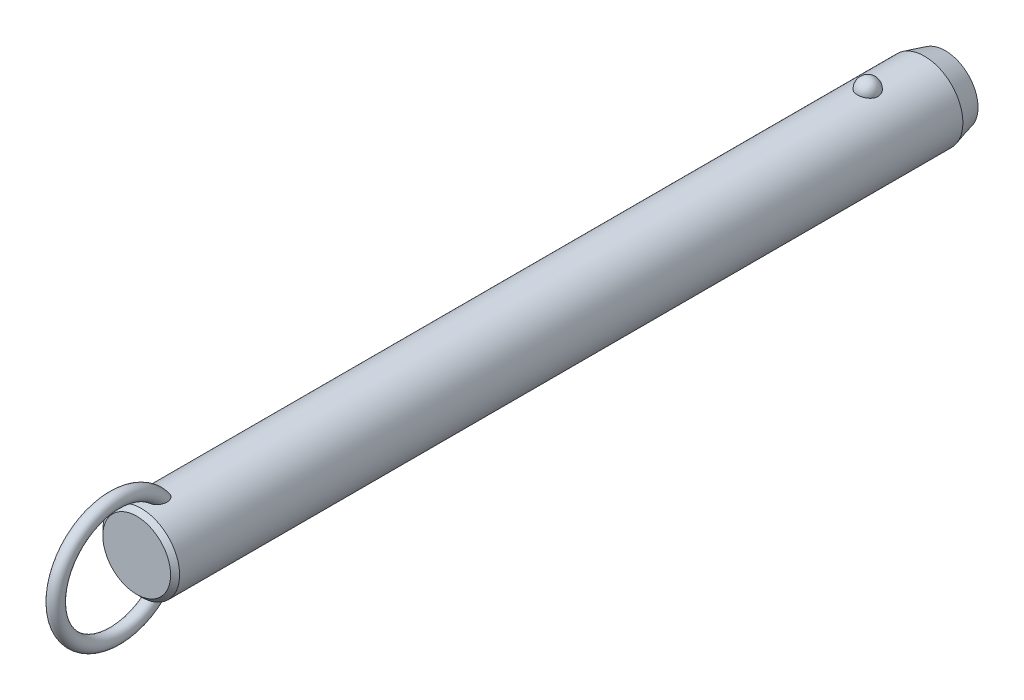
ISO-10303-21;
HEADER;
FILE_DESCRIPTION(('STEP AP214'),'2;1');
FILE_NAME('part.step','',(''),(''),'','','');
FILE_SCHEMA(('AUTOMOTIVE_DESIGN { 1 0 10303 214 1 1 1 1 }'));
ENDSEC;
DATA;
#1=APPLICATION_CONTEXT('core data for automotive mechanical design processes');
#2=APPLICATION_PROTOCOL_DEFINITION('international standard','automotive_design',2000,#1);
#3=PRODUCT_CONTEXT('',#1,'mechanical');
#4=PRODUCT('Part','Part','',(#3));
#5=PRODUCT_RELATED_PRODUCT_CATEGORY('part','',(#4));
#6=PRODUCT_DEFINITION_FORMATION('','',#4);
#7=PRODUCT_DEFINITION_CONTEXT('part definition',#1,'design');
#8=PRODUCT_DEFINITION('design','',#6,#7);
#9=PRODUCT_DEFINITION_SHAPE('','',#8);
#10=(LENGTH_UNIT() NAMED_UNIT(*) SI_UNIT(.MILLI.,.METRE.));
#11=(NAMED_UNIT(*) PLANE_ANGLE_UNIT() SI_UNIT($,.RADIAN.));
#12=(NAMED_UNIT(*) SI_UNIT($,.STERADIAN.) SOLID_ANGLE_UNIT());
#13=UNCERTAINTY_MEASURE_WITH_UNIT(LENGTH_MEASURE(1.E-05),#10,'distance_accuracy_value','');
#14=(GEOMETRIC_REPRESENTATION_CONTEXT(3) GLOBAL_UNCERTAINTY_ASSIGNED_CONTEXT((#13)) GLOBAL_UNIT_ASSIGNED_CONTEXT((#10,
#11,#12)) REPRESENTATION_CONTEXT('',''));
#15=CARTESIAN_POINT('',(0.,0.,0.));
#16=DIRECTION('',(0.,0.,1.));
#17=DIRECTION('',(1.,0.,0.));
#18=AXIS2_PLACEMENT_3D('',#15,#16,#17);
#19=CARTESIAN_POINT('',(0.,0.,195.6));
#20=DIRECTION('',(0.,0.,-1.));
#21=DIRECTION('',(-1.,0.,0.));
#22=AXIS2_PLACEMENT_3D('',#19,#20,#21);
#23=CYLINDRICAL_SURFACE('',#22,11.1);
#24=CARTESIAN_POINT('',(2.9724815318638,10.6945945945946,-3.00000000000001));
#25=CARTESIAN_POINT('',(2.97247830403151,10.6945972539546,-2.8322505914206));
#26=CARTESIAN_POINT('',(2.95876598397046,10.6984356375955,-2.66445972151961));
#27=CARTESIAN_POINT('',(2.90424529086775,10.7133624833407,-2.3336238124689));
#28=CARTESIAN_POINT('',(2.8634252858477,10.7244540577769,-2.17058084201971));
#29=CARTESIAN_POINT('',(2.75573657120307,10.7526272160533,-1.85396767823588));
#30=CARTESIAN_POINT('',(2.68887937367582,10.7697061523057,-1.70039333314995));
#31=CARTESIAN_POINT('',(2.53079696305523,10.8079438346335,-1.4069159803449));
#32=CARTESIAN_POINT('',(2.43957264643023,10.8291024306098,-1.26701246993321));
#33=CARTESIAN_POINT('',(2.23458150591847,10.8732541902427,-1.00409565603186));
#34=CARTESIAN_POINT('',(2.12071295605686,10.8962553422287,-0.881162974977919));
#35=CARTESIAN_POINT('',(1.87365402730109,10.9414421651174,-0.656352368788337));
#36=CARTESIAN_POINT('',(1.74046358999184,10.9636278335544,-0.554474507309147));
#37=CARTESIAN_POINT('',(1.45872188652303,11.0046495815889,-0.374872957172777));
#38=CARTESIAN_POINT('',(1.31021276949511,11.0234944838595,-0.297085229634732));
#39=CARTESIAN_POINT('',(1.00170030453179,11.0557957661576,-0.167529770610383));
#40=CARTESIAN_POINT('',(0.841698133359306,11.0692526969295,-0.1157593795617));
#41=CARTESIAN_POINT('',(0.517607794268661,11.0890932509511,-0.0403925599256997));
#42=CARTESIAN_POINT('',(0.353633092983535,11.0955916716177,-0.0163383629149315));
#43=CARTESIAN_POINT('',(0.0238420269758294,11.1011989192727,0.00445177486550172));
#44=CARTESIAN_POINT('',(-0.141974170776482,11.1003084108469,0.00119017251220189));
#45=CARTESIAN_POINT('',(-0.468405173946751,11.0912990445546,-0.0323233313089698));
#46=CARTESIAN_POINT('',(-0.629059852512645,11.0832767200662,-0.062214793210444));
#47=CARTESIAN_POINT('',(-0.942937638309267,11.0609962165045,-0.147645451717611));
#48=CARTESIAN_POINT('',(-1.09616062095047,11.0467379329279,-0.203185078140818));
#49=CARTESIAN_POINT('',(-1.39181061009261,11.0134071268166,-0.338752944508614));
#50=CARTESIAN_POINT('',(-1.53417383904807,10.9943086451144,-0.418913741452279));
#51=CARTESIAN_POINT('',(-1.80342160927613,10.9533667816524,-0.601448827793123));
#52=CARTESIAN_POINT('',(-1.9303046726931,10.9315231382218,-0.703825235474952));
#53=CARTESIAN_POINT('',(-2.16747598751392,10.887005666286,-0.930091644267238));
#54=CARTESIAN_POINT('',(-2.27742774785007,10.8643239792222,-1.05433291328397));
#55=CARTESIAN_POINT('',(-2.47517316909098,10.8209886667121,-1.31966633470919));
#56=CARTESIAN_POINT('',(-2.56296538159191,10.8003351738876,-1.46075958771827));
#57=CARTESIAN_POINT('',(-2.71500300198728,10.7631304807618,-1.75753646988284));
#58=CARTESIAN_POINT('',(-2.77898901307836,10.7466250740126,-1.91335887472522));
#59=CARTESIAN_POINT('',(-2.88046189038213,10.7198747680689,-2.23391529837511));
#60=CARTESIAN_POINT('',(-2.91794947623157,10.709629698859,-2.3986490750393));
#61=CARTESIAN_POINT('',(-2.96537819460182,10.6965949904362,-2.73165170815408));
#62=CARTESIAN_POINT('',(-2.97542891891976,10.693775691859,-2.89990378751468));
#63=CARTESIAN_POINT('',(-2.96804271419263,10.6958279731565,-3.23575286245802));
#64=CARTESIAN_POINT('',(-2.95060646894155,10.7006993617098,-3.4033498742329));
#65=CARTESIAN_POINT('',(-2.88883358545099,10.71753912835,-3.73233906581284));
#66=CARTESIAN_POINT('',(-2.84462026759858,10.7294749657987,-3.89375610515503));
#67=CARTESIAN_POINT('',(-2.73050447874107,10.7590797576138,-4.20667949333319));
#68=CARTESIAN_POINT('',(-2.66060103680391,10.7767489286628,-4.35818546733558));
#69=CARTESIAN_POINT('',(-2.49642559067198,10.8159599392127,-4.64785421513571));
#70=CARTESIAN_POINT('',(-2.40203047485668,10.8375211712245,-4.78594458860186));
#71=CARTESIAN_POINT('',(-2.19143488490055,10.8820570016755,-5.04410382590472));
#72=CARTESIAN_POINT('',(-2.07523364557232,10.9050316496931,-5.16417205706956));
#73=CARTESIAN_POINT('',(-1.82361254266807,10.9499219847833,-5.3833483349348));
#74=CARTESIAN_POINT('',(-1.68812945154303,10.9718338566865,-5.48238464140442));
#75=CARTESIAN_POINT('',(-1.40191298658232,11.0120611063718,-5.65618873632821));
#76=CARTESIAN_POINT('',(-1.25118062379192,11.0303767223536,-5.73095813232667));
#77=CARTESIAN_POINT('',(-0.940570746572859,11.0611653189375,-5.85334725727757));
#78=CARTESIAN_POINT('',(-0.780821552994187,11.0737044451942,-5.90127578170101));
#79=CARTESIAN_POINT('',(-0.455204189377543,11.0918598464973,-5.96992976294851));
#80=CARTESIAN_POINT('',(-0.289336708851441,11.0974768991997,-5.99065827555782));
#81=CARTESIAN_POINT('',(0.0406846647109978,11.1011307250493,-6.00418773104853));
#82=CARTESIAN_POINT('',(0.204817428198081,11.099299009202,-5.9974731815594));
#83=CARTESIAN_POINT('',(0.5295530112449,11.088551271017,-5.95740317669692));
#84=CARTESIAN_POINT('',(0.69015594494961,11.0796354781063,-5.92404858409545));
#85=CARTESIAN_POINT('',(1.0027760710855,11.0557204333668,-5.83180084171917));
#86=CARTESIAN_POINT('',(1.15482001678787,11.0407414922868,-5.7729929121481));
#87=CARTESIAN_POINT('',(1.44678373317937,11.0062913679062,-5.63147366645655));
#88=CARTESIAN_POINT('',(1.58670279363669,10.9868199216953,-5.54876095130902));
#89=CARTESIAN_POINT('',(1.8527023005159,10.9451315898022,-5.36027644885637));
#90=CARTESIAN_POINT('',(1.97855158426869,10.9228788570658,-5.25418644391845));
#91=CARTESIAN_POINT('',(2.21080872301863,10.8782509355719,-5.02251354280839));
#92=CARTESIAN_POINT('',(2.31721312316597,10.8558757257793,-4.89692718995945));
#93=CARTESIAN_POINT('',(2.5094551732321,10.8130715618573,-4.62745408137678));
#94=CARTESIAN_POINT('',(2.59493284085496,10.7926798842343,-4.48330448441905));
#95=CARTESIAN_POINT('',(2.740862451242,10.7565495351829,-4.18236358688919));
#96=CARTESIAN_POINT('',(2.80132490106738,10.7408089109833,-4.02557762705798));
#97=CARTESIAN_POINT('',(2.88959070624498,10.7173718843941,-3.72475308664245));
#98=CARTESIAN_POINT('',(2.92062102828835,10.7088950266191,-3.58171216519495));
#99=CARTESIAN_POINT('',(2.96206765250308,10.6975052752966,-3.29245795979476));
#100=CARTESIAN_POINT('',(2.97248434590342,10.6945922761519,-3.14624473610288));
#101=CARTESIAN_POINT('',(2.9724815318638,10.6945945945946,-3.00000000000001));
#102=B_SPLINE_CURVE_WITH_KNOTS('',3,(#24,#25,#26,#27,#28,#29,#30,#31,#32,#33,#34,#35,#36,#37,
#38,#39,#40,#41,#42,#43,#44,#45,#46,#47,#48,#49,#50,#51,#52,#53,#54,#55,#56,#57,#58,#59,#60,#61,
#62,#63,#64,#65,#66,#67,#68,#69,#70,#71,#72,#73,#74,#75,#76,#77,#78,#79,#80,#81,#82,#83,#84,#85,
#86,#87,#88,#89,#90,#91,#92,#93,#94,#95,#96,#97,#98,#99,#100,#101),.UNSPECIFIED.,.T.,.F.,(4,2,2,
2,2,2,2,2,2,2,2,2,2,2,2,2,2,2,2,2,2,2,2,2,2,2,2,2,2,2,2,2,2,2,2,2,2,2,4),(0.,0.502722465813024,
1.00566079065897,1.5083769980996,2.01107471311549,2.51608392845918,3.02109467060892,
3.52475118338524,4.02835620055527,4.523518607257,5.0186364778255,5.50715297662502,
5.9956776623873,6.48688002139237,6.97812923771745,7.47814366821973,7.9781907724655,
8.48353712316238,8.9888697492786,9.49218093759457,9.99547960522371,10.4964777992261,
10.997494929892,11.5010810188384,12.0046847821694,12.5099796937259,13.0152411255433,
13.5145635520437,14.0138298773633,14.5043200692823,14.9947943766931,15.4836390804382,
15.9725123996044,16.4685040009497,16.9645836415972,17.4686765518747,17.972557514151,
18.410841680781,18.849117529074),.UNSPECIFIED.);
#103=CARTESIAN_POINT('',(2.9724815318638,10.6945945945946,-3.00000000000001));
#104=VERTEX_POINT('',#103);
#105=EDGE_CURVE('E41',#104,#104,#102,.T.);
#106=ORIENTED_EDGE('',*,*,#105,.T.);
#107=EDGE_LOOP('',(#106));
#108=FACE_BOUND('',#107,.T.);
#109=CARTESIAN_POINT('',(0.,0.,207.));
#110=DIRECTION('',(0.,0.,1.));
#111=DIRECTION('',(1.,0.,0.));
#112=AXIS2_PLACEMENT_3D('',#109,#110,#111);
#113=CIRCLE('',#112,11.1);
#114=CARTESIAN_POINT('',(-11.1,0.,207.));
#115=VERTEX_POINT('',#114);
#116=EDGE_CURVE('E10',#115,#115,#113,.F.);
#117=ORIENTED_EDGE('',*,*,#116,.T.);
#118=EDGE_LOOP('',(#117));
#119=FACE_BOUND('',#118,.T.);
#120=CARTESIAN_POINT('',(-0.564520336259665,-11.0856356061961,199.257815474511));
#121=CARTESIAN_POINT('',(-0.667202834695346,-11.0804062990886,199.291283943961));
#122=CARTESIAN_POINT('',(-0.766875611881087,-11.0738877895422,199.333835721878));
#123=CARTESIAN_POINT('',(-0.95728412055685,-11.0590576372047,199.435419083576));
#124=CARTESIAN_POINT('',(-1.04801616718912,-11.0507452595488,199.49445742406));
#125=CARTESIAN_POINT('',(-1.21800952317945,-11.0333016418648,199.626529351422));
#126=CARTESIAN_POINT('',(-1.2973080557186,-11.0241732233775,199.699515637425));
#127=CARTESIAN_POINT('',(-1.44337665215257,-11.0060026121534,199.857037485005));
#128=CARTESIAN_POINT('',(-1.51014622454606,-10.9969604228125,199.941573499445));
#129=CARTESIAN_POINT('',(-1.63454620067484,-10.9791841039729,200.125521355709));
#130=CARTESIAN_POINT('',(-1.69127003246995,-10.9705107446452,200.225549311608));
#131=CARTESIAN_POINT('',(-1.7898078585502,-10.9548648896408,200.432790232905));
#132=CARTESIAN_POINT('',(-1.83161214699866,-10.9478935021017,200.540007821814));
#133=CARTESIAN_POINT('',(-1.91557028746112,-10.9335803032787,200.805408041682));
#134=CARTESIAN_POINT('',(-1.95040620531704,-10.9273269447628,200.965980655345));
#135=CARTESIAN_POINT('',(-1.99388326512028,-10.9194709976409,201.290697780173));
#136=CARTESIAN_POINT('',(-2.00248051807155,-10.9178762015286,201.454847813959));
#137=CARTESIAN_POINT('',(-1.99551615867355,-10.9191578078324,201.824650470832));
#138=CARTESIAN_POINT('',(-1.9732206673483,-10.9232807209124,202.030191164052));
#139=CARTESIAN_POINT('',(-1.9152976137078,-10.9335244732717,202.333595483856));
#140=CARTESIAN_POINT('',(-1.89184575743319,-10.9376266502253,202.434088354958));
#141=CARTESIAN_POINT('',(-1.83700674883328,-10.9469720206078,202.632855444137));
#142=CARTESIAN_POINT('',(-1.80562070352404,-10.9522150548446,202.731129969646));
#143=CARTESIAN_POINT('',(-1.73463055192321,-10.9636837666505,202.925914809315));
#144=CARTESIAN_POINT('',(-1.69493416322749,-10.9699202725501,203.022390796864));
#145=CARTESIAN_POINT('',(-1.60745141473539,-10.9830806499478,203.211626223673));
#146=CARTESIAN_POINT('',(-1.55966150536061,-10.9900048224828,203.304384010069));
#147=CARTESIAN_POINT('',(-1.45591812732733,-11.0042280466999,203.484690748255));
#148=CARTESIAN_POINT('',(-1.40000013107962,-11.0115253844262,203.572260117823));
#149=CARTESIAN_POINT('',(-1.27937470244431,-11.0261911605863,203.741029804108));
#150=CARTESIAN_POINT('',(-1.21467835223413,-11.0335594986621,203.82223795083));
#151=CARTESIAN_POINT('',(-1.08218150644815,-11.0473027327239,203.969001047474));
#152=CARTESIAN_POINT('',(-1.01522633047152,-11.0537063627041,204.035309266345));
#153=CARTESIAN_POINT('',(-0.872952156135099,-11.065850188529,204.158378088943));
#154=CARTESIAN_POINT('',(-0.797642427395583,-11.0715911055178,204.215149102));
#155=CARTESIAN_POINT('',(-0.651396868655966,-11.081071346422,204.307515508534));
#156=CARTESIAN_POINT('',(-0.581712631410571,-11.0849841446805,204.345049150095));
#157=CARTESIAN_POINT('',(-0.437066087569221,-11.0916271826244,204.408259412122));
#158=CARTESIAN_POINT('',(-0.362109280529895,-11.0943586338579,204.433948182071));
#159=CARTESIAN_POINT('',(-0.207828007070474,-11.0983242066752,204.471117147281));
#160=CARTESIAN_POINT('',(-0.12846771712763,-11.0995432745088,204.482454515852));
#161=CARTESIAN_POINT('',(0.0309101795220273,-11.1002423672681,204.488965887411));
#162=CARTESIAN_POINT('',(0.110927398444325,-11.0997233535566,204.484148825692));
#163=CARTESIAN_POINT('',(0.25640659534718,-11.097240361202,204.460959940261));
#164=CARTESIAN_POINT('',(0.322235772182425,-11.0955074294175,204.444754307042));
#165=CARTESIAN_POINT('',(0.450635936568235,-11.0910350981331,204.402600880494));
#166=CARTESIAN_POINT('',(0.513205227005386,-11.0882951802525,204.376648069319));
#167=CARTESIAN_POINT('',(0.662626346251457,-11.0805620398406,204.302607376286));
#168=CARTESIAN_POINT('',(0.747127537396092,-11.0751144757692,204.249845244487));
#169=CARTESIAN_POINT('',(0.906756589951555,-11.0631932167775,204.131720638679));
#170=CARTESIAN_POINT('',(0.981859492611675,-11.0567168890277,204.066325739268));
#171=CARTESIAN_POINT('',(1.10712207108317,-11.0447856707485,203.94226337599));
#172=CARTESIAN_POINT('',(1.15909566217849,-11.0394280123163,203.885383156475));
#173=CARTESIAN_POINT('',(1.2579192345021,-11.0286040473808,203.767327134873));
#174=CARTESIAN_POINT('',(1.30476642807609,-11.0231376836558,203.706149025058));
#175=CARTESIAN_POINT('',(1.43818612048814,-11.0068027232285,203.517305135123));
#176=CARTESIAN_POINT('',(1.51751767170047,-10.9960104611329,203.384453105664));
#177=CARTESIAN_POINT('',(1.63597546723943,-10.9788847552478,203.153137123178));
#178=CARTESIAN_POINT('',(1.67988876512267,-10.9722190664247,203.057053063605));
#179=CARTESIAN_POINT('',(1.75953241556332,-10.9597298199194,202.861431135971));
#180=CARTESIAN_POINT('',(1.7952596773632,-10.9539065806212,202.761891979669));
#181=CARTESIAN_POINT('',(1.85844731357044,-10.9433632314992,202.56021118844));
#182=CARTESIAN_POINT('',(1.8859107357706,-10.9386427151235,202.45807052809));
#183=CARTESIAN_POINT('',(1.93234324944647,-10.9305350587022,202.251819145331));
#184=CARTESIAN_POINT('',(1.95131065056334,-10.9271481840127,202.147708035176));
#185=CARTESIAN_POINT('',(1.99040203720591,-10.9201183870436,201.865458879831));
#186=CARTESIAN_POINT('',(2.00221217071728,-10.9179256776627,201.686037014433));
#187=CARTESIAN_POINT('',(1.99711676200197,-10.9188636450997,201.327713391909));
#188=CARTESIAN_POINT('',(1.98026150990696,-10.9219849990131,201.148811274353));
#189=CARTESIAN_POINT('',(1.92151657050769,-10.9324473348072,200.83645144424));
#190=CARTESIAN_POINT('',(1.88605081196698,-10.9386915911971,200.701759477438));
#191=CARTESIAN_POINT('',(1.79393020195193,-10.9541780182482,200.439966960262));
#192=CARTESIAN_POINT('',(1.73729868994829,-10.9634168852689,200.312858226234));
#193=CARTESIAN_POINT('',(1.61237037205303,-10.9824218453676,200.089418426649));
#194=CARTESIAN_POINT('',(1.54715374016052,-10.9918945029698,199.991345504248));
#195=CARTESIAN_POINT('',(1.40127026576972,-11.0114415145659,199.807434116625));
#196=CARTESIAN_POINT('',(1.32060742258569,-11.0215157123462,199.721592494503));
#197=CARTESIAN_POINT('',(1.1447478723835,-11.041168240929,199.565163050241));
#198=CARTESIAN_POINT('',(1.04947805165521,-11.0507437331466,199.494656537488));
#199=CARTESIAN_POINT('',(0.847278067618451,-11.0680789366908,199.372640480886));
#200=CARTESIAN_POINT('',(0.740351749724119,-11.0758392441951,199.321124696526));
#201=CARTESIAN_POINT('',(0.529289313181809,-11.0878275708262,199.243485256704));
#202=CARTESIAN_POINT('',(0.425895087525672,-11.0923259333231,199.215377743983));
#203=CARTESIAN_POINT('',(0.215723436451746,-11.0984001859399,199.177703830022));
#204=CARTESIAN_POINT('',(0.10894793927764,-11.0999777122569,199.168127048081));
#205=CARTESIAN_POINT('',(-0.0938962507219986,-11.1000196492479,199.167877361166));
#206=CARTESIAN_POINT('',(-0.189967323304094,-11.0987797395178,199.175408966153));
#207=CARTESIAN_POINT('',(-0.379657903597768,-11.0939111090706,199.205507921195));
#208=CARTESIAN_POINT('',(-0.47327735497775,-11.0902823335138,199.228075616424));
#209=CARTESIAN_POINT('',(-0.564520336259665,-11.0856356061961,199.257815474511));
#210=B_SPLINE_CURVE_WITH_KNOTS('',3,(#120,#121,#122,#123,#124,#125,#126,#127,#128,#129,#130,
#131,#132,#133,#134,#135,#136,#137,#138,#139,#140,#141,#142,#143,#144,#145,#146,#147,#148,#149,
#150,#151,#152,#153,#154,#155,#156,#157,#158,#159,#160,#161,#162,#163,#164,#165,#166,#167,#168,
#169,#170,#171,#172,#173,#174,#175,#176,#177,#178,#179,#180,#181,#182,#183,#184,#185,#186,#187,
#188,#189,#190,#191,#192,#193,#194,#195,#196,#197,#198,#199,#200,#201,#202,#203,#204,#205,#206,
#207,#208,#209),.UNSPECIFIED.,.T.,.F.,(4,2,2,2,2,2,2,2,2,2,2,2,2,2,2,2,2,2,2,2,2,2,2,2,2,2,2,2,
2,2,2,2,2,2,2,2,2,2,2,2,2,2,2,2,4),(0.,0.323999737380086,0.64813245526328,0.971184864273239,
1.29424994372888,1.63886237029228,1.98369857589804,2.47426059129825,2.96564271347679,
3.58257396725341,3.89215258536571,4.20168803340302,4.51486273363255,4.82817514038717,
5.14015911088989,5.45175282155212,5.73442856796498,6.01679375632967,6.2536458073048,
6.49025437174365,6.72919963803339,6.96801276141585,7.17061258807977,7.37331685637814,
7.67094989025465,7.96935728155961,8.20075067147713,8.43226927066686,8.89581623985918,
9.21306533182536,9.53043400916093,9.84768549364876,10.1650000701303,10.7022930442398,
11.2386443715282,11.655339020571,12.071575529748,12.4245637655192,12.7774607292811,
13.1321855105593,13.4867936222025,13.8068771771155,14.1267813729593,14.4146787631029,
14.7025827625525),.UNSPECIFIED.);
#211=CARTESIAN_POINT('',(-0.564520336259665,-11.0856356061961,199.257815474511));
#212=VERTEX_POINT('',#211);
#213=EDGE_CURVE('E59',#212,#212,#210,.T.);
#214=ORIENTED_EDGE('',*,*,#213,.T.);
#215=EDGE_LOOP('',(#214));
#216=FACE_BOUND('',#215,.T.);
#217=CARTESIAN_POINT('',(-0.564520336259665,11.0856356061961,199.257815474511));
#218=CARTESIAN_POINT('',(-0.468542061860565,11.0905203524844,199.226545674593));
#219=CARTESIAN_POINT('',(-0.369793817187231,11.0942886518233,199.203157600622));
#220=CARTESIAN_POINT('',(-0.169555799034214,11.0991586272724,199.173085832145));
#221=CARTESIAN_POINT('',(-0.0680604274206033,11.1002543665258,199.16643932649));
#222=CARTESIAN_POINT('',(0.134549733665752,11.099646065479,199.170157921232));
#223=CARTESIAN_POINT('',(0.235664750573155,11.0979441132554,199.18051033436));
#224=CARTESIAN_POINT('',(0.434632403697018,11.0919342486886,199.217831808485));
#225=CARTESIAN_POINT('',(0.532486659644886,11.0876276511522,199.244792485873));
#226=CARTESIAN_POINT('',(0.722445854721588,11.0768742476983,199.3144096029));
#227=CARTESIAN_POINT('',(0.814543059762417,11.0704246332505,199.357086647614));
#228=CARTESIAN_POINT('',(0.990565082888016,11.0560659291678,199.456648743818));
#229=CARTESIAN_POINT('',(1.07448844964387,11.048156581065,199.513536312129));
#230=CARTESIAN_POINT('',(1.23562672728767,11.0313221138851,199.642210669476));
#231=CARTESIAN_POINT('',(1.3124268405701,11.0223686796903,199.714511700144));
#232=CARTESIAN_POINT('',(1.45398030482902,11.0045918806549,199.870042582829));
#233=CARTESIAN_POINT('',(1.51873073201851,10.9957685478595,199.953275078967));
#234=CARTESIAN_POINT('',(1.64107232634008,10.9782087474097,200.136384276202));
#235=CARTESIAN_POINT('',(1.6974317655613,10.9695572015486,200.237089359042));
#236=CARTESIAN_POINT('',(1.79515063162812,10.9539887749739,200.445626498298));
#237=CARTESIAN_POINT('',(1.83649966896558,10.9470730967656,200.55346343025));
#238=CARTESIAN_POINT('',(1.91931148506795,10.9329211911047,200.820399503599));
#239=CARTESIAN_POINT('',(1.95340104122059,10.9267904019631,200.981861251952));
#240=CARTESIAN_POINT('',(1.99526195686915,10.9192174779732,201.30821631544));
#241=CARTESIAN_POINT('',(2.00298989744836,10.9177830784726,201.47311484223));
#242=CARTESIAN_POINT('',(1.99396251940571,10.9194420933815,201.844100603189));
#243=CARTESIAN_POINT('',(1.97050829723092,10.923774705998,202.05003871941));
#244=CARTESIAN_POINT('',(1.91079643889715,10.9343131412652,202.353901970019));
#245=CARTESIAN_POINT('',(1.88673702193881,10.9385106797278,202.454529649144));
#246=CARTESIAN_POINT('',(1.8306550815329,10.9480376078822,202.653510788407));
#247=CARTESIAN_POINT('',(1.79863369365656,10.9533668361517,202.751864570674));
#248=CARTESIAN_POINT('',(1.72633365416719,10.9649954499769,202.946720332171));
#249=CARTESIAN_POINT('',(1.68596409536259,10.9713053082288,203.04318790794));
#250=CARTESIAN_POINT('',(1.59707998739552,10.9845964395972,203.232323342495));
#251=CARTESIAN_POINT('',(1.54856169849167,10.9915780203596,203.324989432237));
#252=CARTESIAN_POINT('',(1.44330168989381,11.0058935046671,203.504975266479));
#253=CARTESIAN_POINT('',(1.3865974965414,11.0132257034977,203.592316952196));
#254=CARTESIAN_POINT('',(1.2643115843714,11.0279330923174,203.760456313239));
#255=CARTESIAN_POINT('',(1.19874160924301,11.0353082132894,203.841262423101));
#256=CARTESIAN_POINT('',(1.06542088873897,11.048931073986,203.985985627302));
#257=CARTESIAN_POINT('',(0.998640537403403,11.0552153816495,204.050784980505));
#258=CARTESIAN_POINT('',(0.856896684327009,11.0671032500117,204.170846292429));
#259=CARTESIAN_POINT('',(0.781942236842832,11.0727075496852,204.226118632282));
#260=CARTESIAN_POINT('',(0.636276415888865,11.081949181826,204.315972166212));
#261=CARTESIAN_POINT('',(0.566755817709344,11.0857572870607,204.352441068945));
#262=CARTESIAN_POINT('',(0.422602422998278,11.0921860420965,204.413533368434));
#263=CARTESIAN_POINT('',(0.347974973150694,11.0948079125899,204.438168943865));
#264=CARTESIAN_POINT('',(0.194593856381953,11.0985608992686,204.473323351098));
#265=CARTESIAN_POINT('',(0.115807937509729,11.0996777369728,204.483706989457));
#266=CARTESIAN_POINT('',(-0.0422499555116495,11.1002003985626,204.488574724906));
#267=CARTESIAN_POINT('',(-0.121521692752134,11.09960699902,204.483066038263));
#268=CARTESIAN_POINT('',(-0.26604624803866,11.0970123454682,204.458827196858));
#269=CARTESIAN_POINT('',(-0.331661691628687,11.0952283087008,204.442135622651));
#270=CARTESIAN_POINT('',(-0.459588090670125,11.0906663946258,204.399111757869));
#271=CARTESIAN_POINT('',(-0.521897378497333,11.0878880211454,204.372774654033));
#272=CARTESIAN_POINT('',(-0.671446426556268,11.0800342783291,204.297513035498));
#273=CARTESIAN_POINT('',(-0.756250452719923,11.0744969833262,204.243818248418));
#274=CARTESIAN_POINT('',(-0.916349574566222,11.0624045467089,204.123802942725));
#275=CARTESIAN_POINT('',(-0.991618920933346,11.0558467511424,204.057449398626));
#276=CARTESIAN_POINT('',(-1.11713140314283,11.0437783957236,203.931633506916));
#277=CARTESIAN_POINT('',(-1.16920539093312,11.0383619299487,203.873952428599));
#278=CARTESIAN_POINT('',(-1.26817476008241,11.02743010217,203.754280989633));
#279=CARTESIAN_POINT('',(-1.31506731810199,11.0219146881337,203.692288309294));
#280=CARTESIAN_POINT('',(-1.40399813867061,11.0109399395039,203.564784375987));
#281=CARTESIAN_POINT('',(-1.44602864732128,11.0054807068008,203.499267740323));
#282=CARTESIAN_POINT('',(-1.52538779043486,10.9947621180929,203.365422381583));
#283=CARTESIAN_POINT('',(-1.56271516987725,10.9895028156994,203.297092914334));
#284=CARTESIAN_POINT('',(-1.64537943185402,10.9774790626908,203.133210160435));
#285=CARTESIAN_POINT('',(-1.68879497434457,10.9708503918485,203.0366735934));
#286=CARTESIAN_POINT('',(-1.76740738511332,10.9584602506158,202.840236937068));
#287=CARTESIAN_POINT('',(-1.80260120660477,10.95269910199,202.74033561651));
#288=CARTESIAN_POINT('',(-1.86468657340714,10.9423003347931,202.537966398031));
#289=CARTESIAN_POINT('',(-1.8915816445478,10.9376622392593,202.435499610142));
#290=CARTESIAN_POINT('',(-1.93682458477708,10.9297405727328,202.228642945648));
#291=CARTESIAN_POINT('',(-1.95517082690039,10.9264572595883,202.124252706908));
#292=CARTESIAN_POINT('',(-1.99232562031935,10.9197647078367,201.84262876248));
#293=CARTESIAN_POINT('',(-2.00294603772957,10.9177914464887,201.664185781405));
#294=CARTESIAN_POINT('',(-1.99566675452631,10.9191290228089,201.307996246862));
#295=CARTESIAN_POINT('',(-1.97781651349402,10.9224306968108,201.13024902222));
#296=CARTESIAN_POINT('',(-1.91747214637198,10.9331592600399,200.819792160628));
#297=CARTESIAN_POINT('',(-1.88131022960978,10.9395108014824,200.685825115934));
#298=CARTESIAN_POINT('',(-1.78790380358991,10.9551659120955,200.42559757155));
#299=CARTESIAN_POINT('',(-1.73068309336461,10.9644661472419,200.299328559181));
#300=CARTESIAN_POINT('',(-1.60475573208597,10.9835398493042,200.07741565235));
#301=CARTESIAN_POINT('',(-1.53908879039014,10.9930297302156,199.980026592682));
#302=CARTESIAN_POINT('',(-1.39238608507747,11.0125708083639,199.797525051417));
#303=CARTESIAN_POINT('',(-1.31135150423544,11.0226219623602,199.712411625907));
#304=CARTESIAN_POINT('',(-1.14382035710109,11.0411991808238,199.56529943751));
#305=CARTESIAN_POINT('',(-1.0585850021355,11.0497792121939,199.50186930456));
#306=CARTESIAN_POINT('',(-0.878723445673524,11.0655285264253,199.390250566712));
#307=CARTESIAN_POINT('',(-0.784123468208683,11.0727015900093,199.342020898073));
#308=CARTESIAN_POINT('',(-0.646163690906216,11.0812501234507,199.286023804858));
#309=CARTESIAN_POINT('',(-0.605595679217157,11.0835451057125,199.271197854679));
#310=CARTESIAN_POINT('',(-0.564520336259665,11.0856356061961,199.257815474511));
#311=B_SPLINE_CURVE_WITH_KNOTS('',3,(#217,#218,#219,#220,#221,#222,#223,#224,#225,#226,#227,
#228,#229,#230,#231,#232,#233,#234,#235,#236,#237,#238,#239,#240,#241,#242,#243,#244,#245,#246,
#247,#248,#249,#250,#251,#252,#253,#254,#255,#256,#257,#258,#259,#260,#261,#262,#263,#264,#265,
#266,#267,#268,#269,#270,#271,#272,#273,#274,#275,#276,#277,#278,#279,#280,#281,#282,#283,#284,
#285,#286,#287,#288,#289,#290,#291,#292,#293,#294,#295,#296,#297,#298,#299,#300,#301,#302,#303,
#304,#305,#306,#307,#308,#309,#310),.UNSPECIFIED.,.T.,.F.,(4,2,2,2,2,2,2,2,2,2,2,2,2,2,2,2,2,2,
2,2,2,2,2,2,2,2,2,2,2,2,2,2,2,2,2,2,2,2,2,2,2,2,2,2,2,2,4),(0.,0.303061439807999,
0.606795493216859,0.910302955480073,1.21365733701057,1.51741085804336,1.82121821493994,
2.13745205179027,2.45376252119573,2.79958678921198,3.14564996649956,3.63832391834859,
4.13180893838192,4.75031912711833,5.06071926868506,5.37107516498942,5.6850077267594,
5.99908475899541,6.31176519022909,6.62403542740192,6.90315673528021,7.18197194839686,
7.41687778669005,7.65154134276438,7.88841587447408,8.12518286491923,8.32752842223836,
8.52997509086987,8.82986421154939,9.13054668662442,9.36393502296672,9.59744991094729,
9.83133221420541,10.0652767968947,10.383032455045,10.7009056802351,11.0186436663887,
11.3364420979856,11.8705925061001,12.4038159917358,12.8189662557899,13.2336487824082,
13.5857049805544,13.9377340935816,14.2561354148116,14.5736690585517,14.7033687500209),.UNSPECIFIED.);
#312=CARTESIAN_POINT('',(-0.564520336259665,11.0856356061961,199.257815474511));
#313=VERTEX_POINT('',#312);
#314=EDGE_CURVE('E67',#313,#313,#311,.T.);
#315=ORIENTED_EDGE('',*,*,#314,.T.);
#316=EDGE_LOOP('',(#315));
#317=FACE_BOUND('',#316,.T.);
#318=CARTESIAN_POINT('',(0.,0.,-19.3999999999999));
#319=DIRECTION('',(0.,0.,-1.));
#320=DIRECTION('',(-1.,0.,0.));
#321=AXIS2_PLACEMENT_3D('',#318,#319,#320);
#322=CIRCLE('',#321,11.1);
#323=CARTESIAN_POINT('',(-11.1,0.,-19.3999999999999));
#324=VERTEX_POINT('',#323);
#325=EDGE_CURVE('E56',#324,#324,#322,.F.);
#326=ORIENTED_EDGE('',*,*,#325,.T.);
#327=EDGE_LOOP('',(#326));
#328=FACE_BOUND('',#327,.T.);
#329=ADVANCED_FACE('F37',(#108,#119,#216,#317,#328),#23,.T.);
#330=CARTESIAN_POINT('',(0.,0.,-25.4));
#331=DIRECTION('',(0.,0.,-1.));
#332=DIRECTION('',(-1.,0.,0.));
#333=AXIS2_PLACEMENT_3D('',#330,#331,#332);
#334=PLANE('',#333);
#335=CARTESIAN_POINT('',(0.,0.,-25.4));
#336=DIRECTION('',(0.,0.,-1.));
#337=DIRECTION('',(-1.,0.,0.));
#338=AXIS2_PLACEMENT_3D('',#335,#336,#337);
#339=CIRCLE('',#338,9.49230484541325);
#340=CARTESIAN_POINT('',(-9.49230484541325,0.,-25.4));
#341=VERTEX_POINT('',#340);
#342=EDGE_CURVE('E66',#341,#341,#339,.T.);
#343=ORIENTED_EDGE('',*,*,#342,.T.);
#344=EDGE_LOOP('',(#343));
#345=FACE_BOUND('',#344,.T.);
#346=ADVANCED_FACE('F85',(#345),#334,.T.);
#347=CARTESIAN_POINT('',(0.,0.,-25.4));
#348=DIRECTION('',(0.,0.,1.));
#349=DIRECTION('',(1.,0.,0.));
#350=AXIS2_PLACEMENT_3D('',#347,#348,#349);
#351=CONICAL_SURFACE('',#350,9.49230484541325,0.261799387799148);
#352=ORIENTED_EDGE('',*,*,#325,.F.);
#353=EDGE_LOOP('',(#352));
#354=FACE_BOUND('',#353,.T.);
#355=ORIENTED_EDGE('',*,*,#342,.F.);
#356=EDGE_LOOP('',(#355));
#357=FACE_BOUND('',#356,.T.);
#358=ADVANCED_FACE('F83',(#354,#357),#351,.T.);
#359=CARTESIAN_POINT('',(0.,0.,208.3));
#360=DIRECTION('',(0.,0.,1.));
#361=DIRECTION('',(1.,0.,0.));
#362=AXIS2_PLACEMENT_3D('',#359,#360,#361);
#363=PLANE('',#362);
#364=CARTESIAN_POINT('',(0.,0.,208.3));
#365=DIRECTION('',(0.,0.,1.));
#366=DIRECTION('',(1.,0.,0.));
#367=AXIS2_PLACEMENT_3D('',#364,#365,#366);
#368=CIRCLE('',#367,9.79999999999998);
#369=CARTESIAN_POINT('',(-9.79999999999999,0.,208.3));
#370=VERTEX_POINT('',#369);
#371=EDGE_CURVE('E50',#370,#370,#368,.T.);
#372=ORIENTED_EDGE('',*,*,#371,.T.);
#373=EDGE_LOOP('',(#372));
#374=FACE_BOUND('',#373,.T.);
#375=ADVANCED_FACE('F77',(#374),#363,.T.);
#376=CARTESIAN_POINT('',(0.,0.,214.65));
#377=DIRECTION('',(1.,0.,0.));
#378=DIRECTION('',(0.,0.,-1.));
#379=AXIS2_PLACEMENT_3D('',#376,#377,#378);
#380=TOROIDAL_SURFACE('',#379,17.05,2.);
#381=ORIENTED_EDGE('',*,*,#314,.F.);
#382=EDGE_LOOP('',(#381));
#383=FACE_BOUND('',#382,.T.);
#384=ORIENTED_EDGE('',*,*,#213,.F.);
#385=EDGE_LOOP('',(#384));
#386=FACE_BOUND('',#385,.T.);
#387=ADVANCED_FACE('F73',(#383,#386),#380,.T.);
#388=CARTESIAN_POINT('',(0.,0.,208.3));
#389=DIRECTION('',(0.,0.,-1.));
#390=DIRECTION('',(-1.,0.,0.));
#391=AXIS2_PLACEMENT_3D('',#388,#389,#390);
#392=CONICAL_SURFACE('',#391,9.79999999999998,0.785398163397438);
#393=CARTESIAN_POINT('',(-11.1,0.,207.));
#394=CARTESIAN_POINT('',(-11.0864583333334,0.,207.013541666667));
#395=CARTESIAN_POINT('',(-11.0729166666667,0.,207.027083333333));
#396=CARTESIAN_POINT('',(-11.0458333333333,0.,207.054166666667));
#397=CARTESIAN_POINT('',(-11.0322916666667,0.,207.067708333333));
#398=CARTESIAN_POINT('',(-11.0052083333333,0.,207.094791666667));
#399=CARTESIAN_POINT('',(-10.9916666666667,0.,207.108333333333));
#400=CARTESIAN_POINT('',(-10.9645833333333,0.,207.135416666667));
#401=CARTESIAN_POINT('',(-10.9510416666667,0.,207.148958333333));
#402=CARTESIAN_POINT('',(-10.9239583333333,0.,207.176041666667));
#403=CARTESIAN_POINT('',(-10.9104166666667,0.,207.189583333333));
#404=CARTESIAN_POINT('',(-10.8833333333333,0.,207.216666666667));
#405=CARTESIAN_POINT('',(-10.8697916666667,0.,207.230208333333));
#406=CARTESIAN_POINT('',(-10.8427083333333,0.,207.257291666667));
#407=CARTESIAN_POINT('',(-10.8291666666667,0.,207.270833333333));
#408=CARTESIAN_POINT('',(-10.8020833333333,0.,207.297916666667));
#409=CARTESIAN_POINT('',(-10.7885416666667,0.,207.311458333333));
#410=CARTESIAN_POINT('',(-10.7614583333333,0.,207.338541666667));
#411=CARTESIAN_POINT('',(-10.7479166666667,0.,207.352083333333));
#412=CARTESIAN_POINT('',(-10.7208333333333,0.,207.379166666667));
#413=CARTESIAN_POINT('',(-10.7072916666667,0.,207.392708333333));
#414=CARTESIAN_POINT('',(-10.6802083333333,0.,207.419791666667));
#415=CARTESIAN_POINT('',(-10.6666666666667,0.,207.433333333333));
#416=CARTESIAN_POINT('',(-10.6395833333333,0.,207.460416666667));
#417=CARTESIAN_POINT('',(-10.6260416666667,0.,207.473958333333));
#418=CARTESIAN_POINT('',(-10.5989583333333,0.,207.501041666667));
#419=CARTESIAN_POINT('',(-10.5854166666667,0.,207.514583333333));
#420=CARTESIAN_POINT('',(-10.5583333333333,0.,207.541666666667));
#421=CARTESIAN_POINT('',(-10.5447916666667,0.,207.555208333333));
#422=CARTESIAN_POINT('',(-10.5177083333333,0.,207.582291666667));
#423=CARTESIAN_POINT('',(-10.5041666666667,0.,207.595833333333));
#424=CARTESIAN_POINT('',(-10.4770833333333,0.,207.622916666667));
#425=CARTESIAN_POINT('',(-10.4635416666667,0.,207.636458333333));
#426=CARTESIAN_POINT('',(-10.4364583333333,0.,207.663541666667));
#427=CARTESIAN_POINT('',(-10.4229166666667,0.,207.677083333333));
#428=CARTESIAN_POINT('',(-10.3958333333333,0.,207.704166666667));
#429=CARTESIAN_POINT('',(-10.3822916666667,0.,207.717708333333));
#430=CARTESIAN_POINT('',(-10.3552083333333,0.,207.744791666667));
#431=CARTESIAN_POINT('',(-10.3416666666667,0.,207.758333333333));
#432=CARTESIAN_POINT('',(-10.3145833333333,0.,207.785416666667));
#433=CARTESIAN_POINT('',(-10.3010416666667,0.,207.798958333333));
#434=CARTESIAN_POINT('',(-10.2739583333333,0.,207.826041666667));
#435=CARTESIAN_POINT('',(-10.2604166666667,0.,207.839583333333));
#436=CARTESIAN_POINT('',(-10.2333333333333,0.,207.866666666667));
#437=CARTESIAN_POINT('',(-10.2197916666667,0.,207.880208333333));
#438=CARTESIAN_POINT('',(-10.1927083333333,0.,207.907291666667));
#439=CARTESIAN_POINT('',(-10.1791666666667,0.,207.920833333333));
#440=CARTESIAN_POINT('',(-10.1520833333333,0.,207.947916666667));
#441=CARTESIAN_POINT('',(-10.1385416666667,0.,207.961458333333));
#442=CARTESIAN_POINT('',(-10.1114583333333,0.,207.988541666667));
#443=CARTESIAN_POINT('',(-10.0979166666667,0.,208.002083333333));
#444=CARTESIAN_POINT('',(-10.0708333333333,0.,208.029166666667));
#445=CARTESIAN_POINT('',(-10.0572916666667,0.,208.042708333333));
#446=CARTESIAN_POINT('',(-10.0302083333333,0.,208.069791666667));
#447=CARTESIAN_POINT('',(-10.0166666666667,0.,208.083333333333));
#448=CARTESIAN_POINT('',(-9.98958333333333,0.,208.110416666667));
#449=CARTESIAN_POINT('',(-9.97604166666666,0.,208.123958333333));
#450=CARTESIAN_POINT('',(-9.94895833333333,0.,208.151041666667));
#451=CARTESIAN_POINT('',(-9.93541666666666,0.,208.164583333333));
#452=CARTESIAN_POINT('',(-9.90833333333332,0.,208.191666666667));
#453=CARTESIAN_POINT('',(-9.89479166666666,0.,208.205208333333));
#454=CARTESIAN_POINT('',(-9.86770833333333,0.,208.232291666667));
#455=CARTESIAN_POINT('',(-9.85416666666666,0.,208.245833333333));
#456=CARTESIAN_POINT('',(-9.82708333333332,0.,208.272916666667));
#457=CARTESIAN_POINT('',(-9.81354166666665,0.,208.286458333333));
#458=CARTESIAN_POINT('',(-9.79999999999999,0.,208.3));
#459=B_SPLINE_CURVE_WITH_KNOTS('',3,(#393,#394,#395,#396,#397,#398,#399,#400,#401,#402,#403,
#404,#405,#406,#407,#408,#409,#410,#411,#412,#413,#414,#415,#416,#417,#418,#419,#420,#421,#422,
#423,#424,#425,#426,#427,#428,#429,#430,#431,#432,#433,#434,#435,#436,#437,#438,#439,#440,#441,
#442,#443,#444,#445,#446,#447,#448,#449,#450,#451,#452,#453,#454,#455,#456,#457,#458),
.UNSPECIFIED.,.F.,.F.,(4,2,2,2,2,2,2,2,2,2,2,2,2,2,2,2,2,2,2,2,2,2,2,2,2,2,2,2,2,2,2,2,4),(0.,
0.0574524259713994,0.114904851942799,0.172357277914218,0.229809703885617,0.287262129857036,
0.344714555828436,0.402166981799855,0.459619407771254,0.517071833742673,0.574524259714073,
0.631976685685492,0.689429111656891,0.74688153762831,0.80433396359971,0.861786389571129,
0.91923881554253,0.976691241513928,1.03414366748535,1.09159609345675,1.14904851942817,
1.20650094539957,1.26395337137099,1.32140579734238,1.3788582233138,1.4363106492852,
1.49376307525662,1.55121550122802,1.60866792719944,1.66612035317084,1.72357277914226,
1.78102520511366,1.83847763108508),.UNSPECIFIED.);
#460=EDGE_CURVE('BSEAM39',#115,#370,#459,.T.);
#461=ORIENTED_EDGE('',*,*,#116,.F.);
#462=ORIENTED_EDGE('',*,*,#371,.F.);
#463=ORIENTED_EDGE('',*,*,#460,.T.);
#464=ORIENTED_EDGE('',*,*,#460,.F.);
#465=EDGE_LOOP('',(#461,#463,#462,#464));
#466=FACE_BOUND('',#465,.T.);
#467=ADVANCED_FACE('F39',(#466),#392,.T.);
#468=CARTESIAN_POINT('',(0.,11.1,-3.00000000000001));
#469=DIRECTION('',(0.,1.,0.));
#470=DIRECTION('',(0.,0.,-1.));
#471=AXIS2_PLACEMENT_3D('',#468,#469,#470);
#472=SPHERICAL_SURFACE('',#471,3.);
#473=ORIENTED_EDGE('',*,*,#105,.F.);
#474=EDGE_LOOP('',(#473));
#475=FACE_BOUND('',#474,.T.);
#476=ADVANCED_FACE('F79',(#475),#472,.T.);
#477=CLOSED_SHELL('',(#329,#346,#358,#375,#387,#467,#476));
#478=MANIFOLD_SOLID_BREP('B2',#477);
#479=ADVANCED_BREP_SHAPE_REPRESENTATION('',(#18,#478),#14);
#480=SHAPE_DEFINITION_REPRESENTATION(#9,#479);
ENDSEC;
END-ISO-10303-21;
